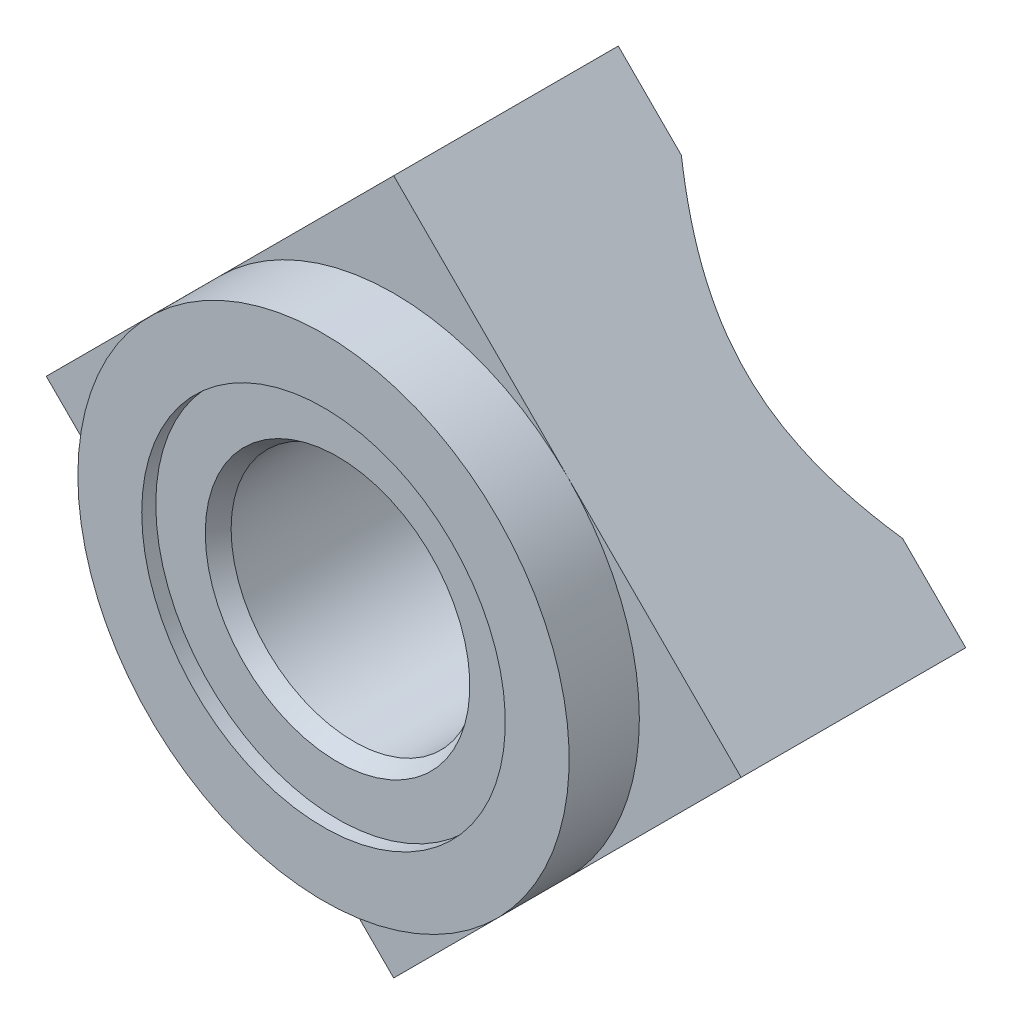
from build123d import *
from OCP.BRepFilletAPI import BRepFilletAPI_MakeChamfer

# Parameters (mm, degrees)
SKETCH1_W        = 7
SKETCH1_H        = 7
BASENUT_DEPTH    = 3.5
SKETCH4_R        = 1.75
HOLE_DEPTH       = 9.227945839
ENDCHAMFER_SIZE  = 0.233333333
ENDCHAMFER_SIZE2 = 0.134715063
EXTRUDE1_DEPTH   = 0.7


with BuildPart() as part:
    # Sketch1 → BaseNut (new body)
    with BuildSketch(Plane(origin=(0, 0, 0), x_dir=(0.7071067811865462, 0.7071067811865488, 0), z_dir=(0, 0, 1))):
        Rectangle(SKETCH1_W, SKETCH1_H)
    extrude(amount=-BASENUT_DEPTH)

    # Sketch3 → Bearing-Face (revolve, cut)
    with BuildSketch(Plane(origin=(0, 5.996043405, -1.046295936), x_dir=(0, 0, 1), z_dir=(-1, 0, 0)), mode=Mode.PRIVATE) as bearing_face_sk:
        Polygon((0.046295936, -9.496043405), (0.046295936, -10.945790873), (1.846295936, -10.945790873), (1.846295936, -5.996043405), (0.846295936, -5.996043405), (0.846295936, -8.586043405), (1.046295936, -8.586043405), (1.046295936, -9.496043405), align=None)
    revolve(bearing_face_sk.sketch.rotate(Axis((0, 0, -1.046295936), (0, 0, 1)), 270), axis=Axis((0, 0, -1.046295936), (0, 0, 1)), mode=Mode.SUBTRACT)

    # Sketch4 → Hole (cut, through all)
    with BuildSketch(Plane(origin=(0.057253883, -0.561970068, -3.5), x_dir=(-1, 0, 0), z_dir=(0, 0, -1))):
        with Locations((0.057253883, 0.561970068)):
            Circle(SKETCH4_R)
    extrude(amount=-HOLE_DEPTH, mode=Mode.SUBTRACT)

    # EndChamfer: one chamfer whose edges measure the first distance from different faces: ONE call of the kernel's chamfer builder (chamfer() names one face for all edges)
    endchamfer_edges_1 = [part.edges().sort_by_distance(p)[0] for p in [
        (1.75, 0, -0.2),
    ]]
    endchamfer_side_1 = [part.faces().sort_by_distance(p)[0] for p in [
        (1.75, 0, -1.85),
    ]]
    endchamfer_edges_2 = [part.edges().sort_by_distance(p)[0] for p in [
        (1.75, 0, -3.5),
    ]]
    endchamfer_side_2 = [part.faces().sort_by_distance(p)[0] for p in [
        (-2.375878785, 2.375878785, -3.5),
    ]]
    endchamfer = BRepFilletAPI_MakeChamfer(part.part.solid().wrapped)
    for e in endchamfer_edges_1:
        endchamfer.Add(ENDCHAMFER_SIZE, ENDCHAMFER_SIZE2, e.wrapped, endchamfer_side_1[0].wrapped)  # the first distance lies on this face
    for e in endchamfer_edges_2:
        endchamfer.Add(ENDCHAMFER_SIZE, ENDCHAMFER_SIZE2, e.wrapped, endchamfer_side_2[0].wrapped)  # the first distance lies on this face
    add(Compound.cast(endchamfer.Shape()), mode=Mode.REPLACE)

    # Sketch8 → Extrude1 (add)
    with BuildSketch(Plane(origin=(0, 0, -3.5), x_dir=(-1, 0, 0), z_dir=(0, 0, -1))):
        Polygon((-4.949747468, 0), (0, 4.949747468), (4.949747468, 0), (0, -4.949747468), align=None)
    extrude(amount=EXTRUDE1_DEPTH)

    # Sketch9 → Cut-Revolve1 (revolve, cut)
    with BuildSketch(Plane(origin=(2.504771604, 0, 1.644975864), x_dir=(0, 0, 1), z_dir=(0, 1, 0)), mode=Mode.PRIVATE) as cut_revolve1_sk:
        Polygon((-5.144975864, -2.504771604), (-5.144975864, -5.954519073), (-5.844975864, -6.654519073), (-5.844975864, -2.504771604), align=None)
    revolve(cut_revolve1_sk.sketch.rotate(Axis((0, 0, 5.820812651), (0, 0, -1)), 347.496441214), axis=Axis((0, 0, 5.820812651), (0, 0, -1)), mode=Mode.SUBTRACT)


solid = part.part
